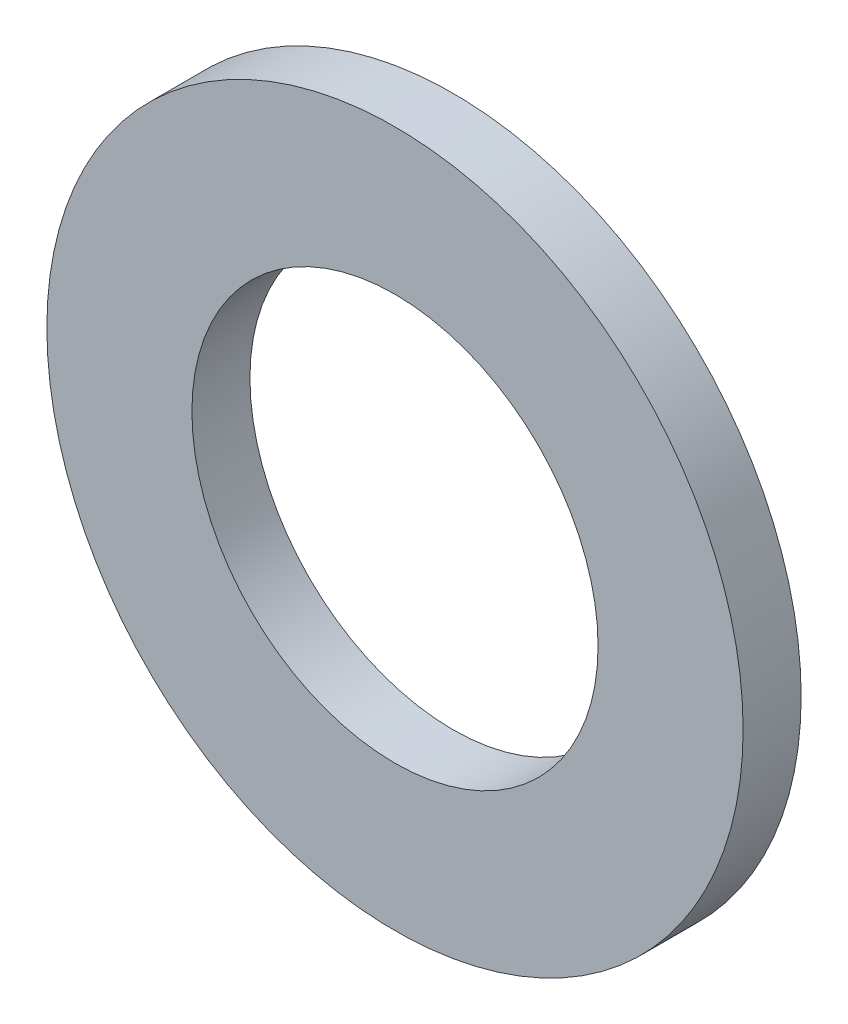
from build123d import *

# Parameters (mm, degrees)
ESQUISSE1_R      = 18
ESQUISSE1_R_2    = 10.5
EXTRUSION1_DEPTH = 3


with BuildPart() as part:
    # Esquisse1 → Extrusion1 (new body)
    with BuildSketch(Plane.XY):
        Circle(ESQUISSE1_R)
        Circle(ESQUISSE1_R_2, mode=Mode.SUBTRACT)
    extrude(amount=EXTRUSION1_DEPTH)


solid = part.part
